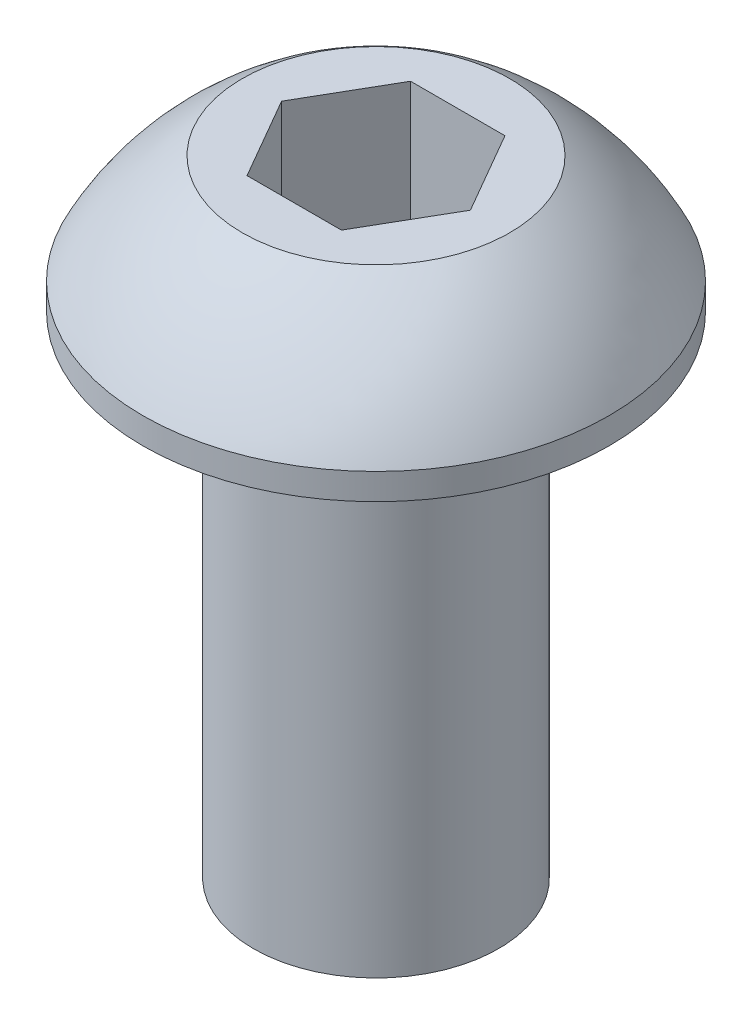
ISO-10303-21;
HEADER;
FILE_DESCRIPTION(('STEP AP214'),'2;1');
FILE_NAME('part.step','',(''),(''),'','','');
FILE_SCHEMA(('AUTOMOTIVE_DESIGN { 1 0 10303 214 1 1 1 1 }'));
ENDSEC;
DATA;
#1=APPLICATION_CONTEXT('core data for automotive mechanical design processes');
#2=APPLICATION_PROTOCOL_DEFINITION('international standard','automotive_design',2000,#1);
#3=PRODUCT_CONTEXT('',#1,'mechanical');
#4=PRODUCT('Part','Part','',(#3));
#5=PRODUCT_RELATED_PRODUCT_CATEGORY('part','',(#4));
#6=PRODUCT_DEFINITION_FORMATION('','',#4);
#7=PRODUCT_DEFINITION_CONTEXT('part definition',#1,'design');
#8=PRODUCT_DEFINITION('design','',#6,#7);
#9=PRODUCT_DEFINITION_SHAPE('','',#8);
#10=(LENGTH_UNIT() NAMED_UNIT(*) SI_UNIT(.MILLI.,.METRE.));
#11=(NAMED_UNIT(*) PLANE_ANGLE_UNIT() SI_UNIT($,.RADIAN.));
#12=(NAMED_UNIT(*) SI_UNIT($,.STERADIAN.) SOLID_ANGLE_UNIT());
#13=UNCERTAINTY_MEASURE_WITH_UNIT(LENGTH_MEASURE(1.E-05),#10,'distance_accuracy_value','');
#14=(GEOMETRIC_REPRESENTATION_CONTEXT(3) GLOBAL_UNCERTAINTY_ASSIGNED_CONTEXT((#13)) GLOBAL_UNIT_ASSIGNED_CONTEXT((#10,
#11,#12)) REPRESENTATION_CONTEXT('',''));
#15=CARTESIAN_POINT('',(0.,0.,0.));
#16=DIRECTION('',(0.,0.,1.));
#17=DIRECTION('',(1.,0.,0.));
#18=AXIS2_PLACEMENT_3D('',#15,#16,#17);
#19=CARTESIAN_POINT('',(0.,1.65,0.));
#20=DIRECTION('',(0.,-1.,0.));
#21=DIRECTION('',(0.,0.,-1.));
#22=AXIS2_PLACEMENT_3D('',#19,#20,#21);
#23=PLANE('',#22);
#24=DIRECTION('',(0.499999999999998,0.,-0.866025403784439));
#25=VECTOR('',#24,1.);
#26=CARTESIAN_POINT('',(0.577350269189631,1.65,1.));
#27=LINE('',#26,#25);
#28=CARTESIAN_POINT('',(0.577350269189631,1.65,1.));
#29=VERTEX_POINT('',#28);
#30=CARTESIAN_POINT('',(1.15470053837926,1.65,0.));
#31=VERTEX_POINT('',#30);
#32=EDGE_CURVE('E124',#29,#31,#27,.T.);
#33=ORIENTED_EDGE('',*,*,#32,.F.);
#34=DIRECTION('',(1.,0.,0.));
#35=VECTOR('',#34,1.);
#36=CARTESIAN_POINT('',(0.577350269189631,1.65,1.));
#37=LINE('',#36,#35);
#38=CARTESIAN_POINT('',(-0.577350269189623,1.65,1.));
#39=VERTEX_POINT('',#38);
#40=EDGE_CURVE('E50',#39,#29,#37,.T.);
#41=ORIENTED_EDGE('',*,*,#40,.F.);
#42=DIRECTION('',(0.500000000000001,0.,0.866025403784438));
#43=VECTOR('',#42,1.);
#44=CARTESIAN_POINT('',(-1.15470053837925,1.65,0.));
#45=LINE('',#44,#43);
#46=CARTESIAN_POINT('',(-1.15470053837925,1.65,0.));
#47=VERTEX_POINT('',#46);
#48=EDGE_CURVE('E133',#47,#39,#45,.T.);
#49=ORIENTED_EDGE('',*,*,#48,.F.);
#50=DIRECTION('',(-0.500000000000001,0.,0.866025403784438));
#51=VECTOR('',#50,1.);
#52=CARTESIAN_POINT('',(-1.15470053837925,1.65,0.));
#53=LINE('',#52,#51);
#54=CARTESIAN_POINT('',(-0.577350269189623,1.65,-1.));
#55=VERTEX_POINT('',#54);
#56=EDGE_CURVE('E131',#55,#47,#53,.T.);
#57=ORIENTED_EDGE('',*,*,#56,.F.);
#58=DIRECTION('',(-1.,0.,0.));
#59=VECTOR('',#58,1.);
#60=CARTESIAN_POINT('',(0.57735026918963,1.65,-1.));
#61=LINE('',#60,#59);
#62=CARTESIAN_POINT('',(0.57735026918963,1.65,-1.));
#63=VERTEX_POINT('',#62);
#64=EDGE_CURVE('E98',#63,#55,#61,.T.);
#65=ORIENTED_EDGE('',*,*,#64,.F.);
#66=DIRECTION('',(-0.499999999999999,0.,-0.866025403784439));
#67=VECTOR('',#66,1.);
#68=CARTESIAN_POINT('',(0.57735026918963,1.65,-1.));
#69=LINE('',#68,#67);
#70=EDGE_CURVE('E127',#31,#63,#69,.T.);
#71=ORIENTED_EDGE('',*,*,#70,.F.);
#72=EDGE_LOOP('',(#33,#41,#49,#57,#65,#71));
#73=FACE_BOUND('',#72,.T.);
#74=CARTESIAN_POINT('',(0.,1.65,0.));
#75=DIRECTION('',(0.,1.,0.));
#76=DIRECTION('',(0.,0.,1.));
#77=AXIS2_PLACEMENT_3D('',#74,#75,#76);
#78=CIRCLE('',#77,1.63497817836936);
#79=CARTESIAN_POINT('',(0.,1.65,1.63497817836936));
#80=VERTEX_POINT('',#79);
#81=EDGE_CURVE('E11',#80,#80,#78,.T.);
#82=ORIENTED_EDGE('',*,*,#81,.T.);
#83=EDGE_LOOP('',(#82));
#84=FACE_BOUND('',#83,.T.);
#85=ADVANCED_FACE('F36',(#73,#84),#23,.F.);
#86=CARTESIAN_POINT('',(0.,-1.20255616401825,0.));
#87=DIRECTION('',(0.,1.,0.));
#88=DIRECTION('',(0.,0.,1.));
#89=AXIS2_PLACEMENT_3D('',#86,#87,#88);
#90=DEGENERATE_TOROIDAL_SURFACE('',#89,0.151780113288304,3.36594442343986,.F.);
#91=ORIENTED_EDGE('',*,*,#81,.F.);
#92=EDGE_LOOP('',(#91));
#93=FACE_BOUND('',#92,.T.);
#94=CARTESIAN_POINT('',(0.,0.320236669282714,0.));
#95=DIRECTION('',(0.,1.,0.));
#96=DIRECTION('',(0.,0.,1.));
#97=AXIS2_PLACEMENT_3D('',#94,#95,#96);
#98=CIRCLE('',#97,2.85);
#99=CARTESIAN_POINT('',(0.,0.320236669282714,2.85));
#100=VERTEX_POINT('',#99);
#101=EDGE_CURVE('E43',#100,#100,#98,.T.);
#102=ORIENTED_EDGE('',*,*,#101,.T.);
#103=EDGE_LOOP('',(#102));
#104=FACE_BOUND('',#103,.T.);
#105=ADVANCED_FACE('F153',(#93,#104),#90,.F.);
#106=CARTESIAN_POINT('',(0.,9.90721096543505,0.));
#107=DIRECTION('',(0.,1.,0.));
#108=DIRECTION('',(0.,0.,1.));
#109=AXIS2_PLACEMENT_3D('',#106,#107,#108);
#110=CYLINDRICAL_SURFACE('',#109,2.85);
#111=ORIENTED_EDGE('',*,*,#101,.F.);
#112=EDGE_LOOP('',(#111));
#113=FACE_BOUND('',#112,.T.);
#114=CARTESIAN_POINT('',(0.,0.,0.));
#115=DIRECTION('',(0.,1.,0.));
#116=DIRECTION('',(0.,0.,1.));
#117=AXIS2_PLACEMENT_3D('',#114,#115,#116);
#118=CIRCLE('',#117,2.85);
#119=CARTESIAN_POINT('',(0.,0.,2.85));
#120=VERTEX_POINT('',#119);
#121=EDGE_CURVE('E148',#120,#120,#118,.T.);
#122=ORIENTED_EDGE('',*,*,#121,.T.);
#123=EDGE_LOOP('',(#122));
#124=FACE_BOUND('',#123,.T.);
#125=ADVANCED_FACE('F155',(#113,#124),#110,.T.);
#126=CARTESIAN_POINT('',(2.85,0.,0.));
#127=DIRECTION('',(0.,1.,0.));
#128=DIRECTION('',(0.,0.,1.));
#129=AXIS2_PLACEMENT_3D('',#126,#127,#128);
#130=PLANE('',#129);
#131=ORIENTED_EDGE('',*,*,#121,.F.);
#132=EDGE_LOOP('',(#131));
#133=FACE_BOUND('',#132,.T.);
#134=CARTESIAN_POINT('',(0.,0.,0.));
#135=DIRECTION('',(0.,1.,0.));
#136=DIRECTION('',(0.,0.,1.));
#137=AXIS2_PLACEMENT_3D('',#134,#135,#136);
#138=CIRCLE('',#137,1.5);
#139=CARTESIAN_POINT('',(0.,0.,1.5));
#140=VERTEX_POINT('',#139);
#141=EDGE_CURVE('E145',#140,#140,#138,.T.);
#142=ORIENTED_EDGE('',*,*,#141,.T.);
#143=EDGE_LOOP('',(#142));
#144=FACE_BOUND('',#143,.T.);
#145=ADVANCED_FACE('F158',(#133,#144),#130,.F.);
#146=CARTESIAN_POINT('',(0.,9.90721096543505,0.));
#147=DIRECTION('',(0.,1.,0.));
#148=DIRECTION('',(0.,0.,1.));
#149=AXIS2_PLACEMENT_3D('',#146,#147,#148);
#150=CYLINDRICAL_SURFACE('',#149,1.5);
#151=ORIENTED_EDGE('',*,*,#141,.F.);
#152=EDGE_LOOP('',(#151));
#153=FACE_BOUND('',#152,.T.);
#154=CARTESIAN_POINT('',(0.,-6.,0.));
#155=DIRECTION('',(0.,1.,0.));
#156=DIRECTION('',(0.,0.,1.));
#157=AXIS2_PLACEMENT_3D('',#154,#155,#156);
#158=CIRCLE('',#157,1.5);
#159=CARTESIAN_POINT('',(0.,-6.,1.5));
#160=VERTEX_POINT('',#159);
#161=EDGE_CURVE('E137',#160,#160,#158,.T.);
#162=ORIENTED_EDGE('',*,*,#161,.T.);
#163=EDGE_LOOP('',(#162));
#164=FACE_BOUND('',#163,.T.);
#165=ADVANCED_FACE('F164',(#153,#164),#150,.T.);
#166=CARTESIAN_POINT('',(1.5,-6.,0.));
#167=DIRECTION('',(0.,1.,0.));
#168=DIRECTION('',(0.,0.,1.));
#169=AXIS2_PLACEMENT_3D('',#166,#167,#168);
#170=PLANE('',#169);
#171=ORIENTED_EDGE('',*,*,#161,.F.);
#172=EDGE_LOOP('',(#171));
#173=FACE_BOUND('',#172,.T.);
#174=ADVANCED_FACE('F170',(#173),#170,.F.);
#175=CARTESIAN_POINT('',(0.577350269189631,0.125999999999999,1.));
#176=DIRECTION('',(0.,0.,1.));
#177=DIRECTION('',(1.,0.,0.));
#178=AXIS2_PLACEMENT_3D('',#175,#176,#177);
#179=PLANE('',#178);
#180=ORIENTED_EDGE('',*,*,#40,.T.);
#181=DIRECTION('',(0.,1.,0.));
#182=VECTOR('',#181,1.);
#183=CARTESIAN_POINT('',(0.577350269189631,0.125999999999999,1.));
#184=LINE('',#183,#182);
#185=CARTESIAN_POINT('',(0.577350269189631,0.125999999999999,1.));
#186=VERTEX_POINT('',#185);
#187=EDGE_CURVE('E80',#186,#29,#184,.T.);
#188=ORIENTED_EDGE('',*,*,#187,.F.);
#189=DIRECTION('',(1.,0.,0.));
#190=VECTOR('',#189,1.);
#191=CARTESIAN_POINT('',(0.577350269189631,0.125999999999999,1.));
#192=LINE('',#191,#190);
#193=CARTESIAN_POINT('',(-0.577350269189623,0.125999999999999,1.));
#194=VERTEX_POINT('',#193);
#195=EDGE_CURVE('E135',#194,#186,#192,.T.);
#196=ORIENTED_EDGE('',*,*,#195,.F.);
#197=DIRECTION('',(0.,1.,0.));
#198=VECTOR('',#197,1.);
#199=CARTESIAN_POINT('',(-0.577350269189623,0.125999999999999,1.));
#200=LINE('',#199,#198);
#201=EDGE_CURVE('E58',#194,#39,#200,.T.);
#202=ORIENTED_EDGE('',*,*,#201,.T.);
#203=EDGE_LOOP('',(#180,#188,#196,#202));
#204=FACE_BOUND('',#203,.T.);
#205=ADVANCED_FACE('F175',(#204),#179,.F.);
#206=CARTESIAN_POINT('',(-1.15470053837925,0.125999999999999,0.));
#207=DIRECTION('',(-0.866025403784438,0.,0.500000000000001));
#208=DIRECTION('',(0.500000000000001,0.,0.866025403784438));
#209=AXIS2_PLACEMENT_3D('',#206,#207,#208);
#210=PLANE('',#209);
#211=ORIENTED_EDGE('',*,*,#48,.T.);
#212=ORIENTED_EDGE('',*,*,#201,.F.);
#213=DIRECTION('',(0.500000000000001,0.,0.866025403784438));
#214=VECTOR('',#213,1.);
#215=CARTESIAN_POINT('',(-1.15470053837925,0.125999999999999,0.));
#216=LINE('',#215,#214);
#217=CARTESIAN_POINT('',(-1.15470053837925,0.125999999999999,0.));
#218=VERTEX_POINT('',#217);
#219=EDGE_CURVE('E110',#218,#194,#216,.T.);
#220=ORIENTED_EDGE('',*,*,#219,.F.);
#221=DIRECTION('',(0.,1.,0.));
#222=VECTOR('',#221,1.);
#223=CARTESIAN_POINT('',(-1.15470053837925,0.125999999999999,0.));
#224=LINE('',#223,#222);
#225=EDGE_CURVE('E102',#218,#47,#224,.T.);
#226=ORIENTED_EDGE('',*,*,#225,.T.);
#227=EDGE_LOOP('',(#211,#212,#220,#226));
#228=FACE_BOUND('',#227,.T.);
#229=ADVANCED_FACE('F180',(#228),#210,.F.);
#230=CARTESIAN_POINT('',(-1.15470053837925,0.125999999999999,0.));
#231=DIRECTION('',(-0.866025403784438,0.,-0.500000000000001));
#232=DIRECTION('',(-0.500000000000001,0.,0.866025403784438));
#233=AXIS2_PLACEMENT_3D('',#230,#231,#232);
#234=PLANE('',#233);
#235=ORIENTED_EDGE('',*,*,#56,.T.);
#236=ORIENTED_EDGE('',*,*,#225,.F.);
#237=DIRECTION('',(-0.500000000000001,0.,0.866025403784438));
#238=VECTOR('',#237,1.);
#239=CARTESIAN_POINT('',(-1.15470053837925,0.125999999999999,0.));
#240=LINE('',#239,#238);
#241=CARTESIAN_POINT('',(-0.577350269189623,0.125999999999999,-1.));
#242=VERTEX_POINT('',#241);
#243=EDGE_CURVE('E106',#242,#218,#240,.T.);
#244=ORIENTED_EDGE('',*,*,#243,.F.);
#245=DIRECTION('',(0.,1.,0.));
#246=VECTOR('',#245,1.);
#247=CARTESIAN_POINT('',(-0.577350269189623,0.125999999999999,-1.));
#248=LINE('',#247,#246);
#249=EDGE_CURVE('E91',#242,#55,#248,.T.);
#250=ORIENTED_EDGE('',*,*,#249,.T.);
#251=EDGE_LOOP('',(#235,#236,#244,#250));
#252=FACE_BOUND('',#251,.T.);
#253=ADVANCED_FACE('F107',(#252),#234,.F.);
#254=CARTESIAN_POINT('',(0.57735026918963,0.125999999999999,-1.));
#255=DIRECTION('',(0.,0.,-1.));
#256=DIRECTION('',(-1.,0.,0.));
#257=AXIS2_PLACEMENT_3D('',#254,#255,#256);
#258=PLANE('',#257);
#259=ORIENTED_EDGE('',*,*,#64,.T.);
#260=ORIENTED_EDGE('',*,*,#249,.F.);
#261=DIRECTION('',(-1.,0.,0.));
#262=VECTOR('',#261,1.);
#263=CARTESIAN_POINT('',(0.57735026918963,0.125999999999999,-1.));
#264=LINE('',#263,#262);
#265=CARTESIAN_POINT('',(0.57735026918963,0.125999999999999,-1.));
#266=VERTEX_POINT('',#265);
#267=EDGE_CURVE('E95',#266,#242,#264,.T.);
#268=ORIENTED_EDGE('',*,*,#267,.F.);
#269=DIRECTION('',(0.,1.,0.));
#270=VECTOR('',#269,1.);
#271=CARTESIAN_POINT('',(0.57735026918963,0.125999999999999,-1.));
#272=LINE('',#271,#270);
#273=EDGE_CURVE('E103',#266,#63,#272,.T.);
#274=ORIENTED_EDGE('',*,*,#273,.T.);
#275=EDGE_LOOP('',(#259,#260,#268,#274));
#276=FACE_BOUND('',#275,.T.);
#277=ADVANCED_FACE('F93',(#276),#258,.F.);
#278=CARTESIAN_POINT('',(0.57735026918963,0.125999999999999,-1.));
#279=DIRECTION('',(0.866025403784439,0.,-0.499999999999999));
#280=DIRECTION('',(-0.499999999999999,0.,-0.866025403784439));
#281=AXIS2_PLACEMENT_3D('',#278,#279,#280);
#282=PLANE('',#281);
#283=ORIENTED_EDGE('',*,*,#70,.T.);
#284=ORIENTED_EDGE('',*,*,#273,.F.);
#285=DIRECTION('',(-0.499999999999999,0.,-0.866025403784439));
#286=VECTOR('',#285,1.);
#287=CARTESIAN_POINT('',(0.57735026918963,0.125999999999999,-1.));
#288=LINE('',#287,#286);
#289=CARTESIAN_POINT('',(1.15470053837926,0.125999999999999,0.));
#290=VERTEX_POINT('',#289);
#291=EDGE_CURVE('E116',#290,#266,#288,.T.);
#292=ORIENTED_EDGE('',*,*,#291,.F.);
#293=DIRECTION('',(0.,1.,0.));
#294=VECTOR('',#293,1.);
#295=CARTESIAN_POINT('',(1.15470053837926,0.125999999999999,0.));
#296=LINE('',#295,#294);
#297=EDGE_CURVE('E140',#290,#31,#296,.T.);
#298=ORIENTED_EDGE('',*,*,#297,.T.);
#299=EDGE_LOOP('',(#283,#284,#292,#298));
#300=FACE_BOUND('',#299,.T.);
#301=ADVANCED_FACE('F206',(#300),#282,.F.);
#302=CARTESIAN_POINT('',(0.577350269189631,0.125999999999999,1.));
#303=DIRECTION('',(0.86602540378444,0.,0.499999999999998));
#304=DIRECTION('',(0.499999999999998,0.,-0.86602540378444));
#305=AXIS2_PLACEMENT_3D('',#302,#303,#304);
#306=PLANE('',#305);
#307=ORIENTED_EDGE('',*,*,#32,.T.);
#308=ORIENTED_EDGE('',*,*,#297,.F.);
#309=DIRECTION('',(0.499999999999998,0.,-0.866025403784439));
#310=VECTOR('',#309,1.);
#311=CARTESIAN_POINT('',(0.577350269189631,0.125999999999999,1.));
#312=LINE('',#311,#310);
#313=EDGE_CURVE('E118',#186,#290,#312,.T.);
#314=ORIENTED_EDGE('',*,*,#313,.F.);
#315=ORIENTED_EDGE('',*,*,#187,.T.);
#316=EDGE_LOOP('',(#307,#308,#314,#315));
#317=FACE_BOUND('',#316,.T.);
#318=ADVANCED_FACE('F194',(#317),#306,.F.);
#319=CARTESIAN_POINT('',(0.577350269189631,0.125999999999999,1.));
#320=DIRECTION('',(0.,-1.,0.));
#321=DIRECTION('',(0.,0.,-1.));
#322=AXIS2_PLACEMENT_3D('',#319,#320,#321);
#323=PLANE('',#322);
#324=ORIENTED_EDGE('',*,*,#195,.T.);
#325=ORIENTED_EDGE('',*,*,#313,.T.);
#326=ORIENTED_EDGE('',*,*,#291,.T.);
#327=ORIENTED_EDGE('',*,*,#267,.T.);
#328=ORIENTED_EDGE('',*,*,#243,.T.);
#329=ORIENTED_EDGE('',*,*,#219,.T.);
#330=EDGE_LOOP('',(#324,#325,#326,#327,#328,#329));
#331=FACE_BOUND('',#330,.T.);
#332=ADVANCED_FACE('F113',(#331),#323,.F.);
#333=CLOSED_SHELL('',(#85,#105,#125,#145,#165,#174,#205,#229,#253,#277,#301,#318,#332));
#334=MANIFOLD_SOLID_BREP('B2',#333);
#335=ADVANCED_BREP_SHAPE_REPRESENTATION('',(#18,#334),#14);
#336=SHAPE_DEFINITION_REPRESENTATION(#9,#335);
ENDSEC;
END-ISO-10303-21;
